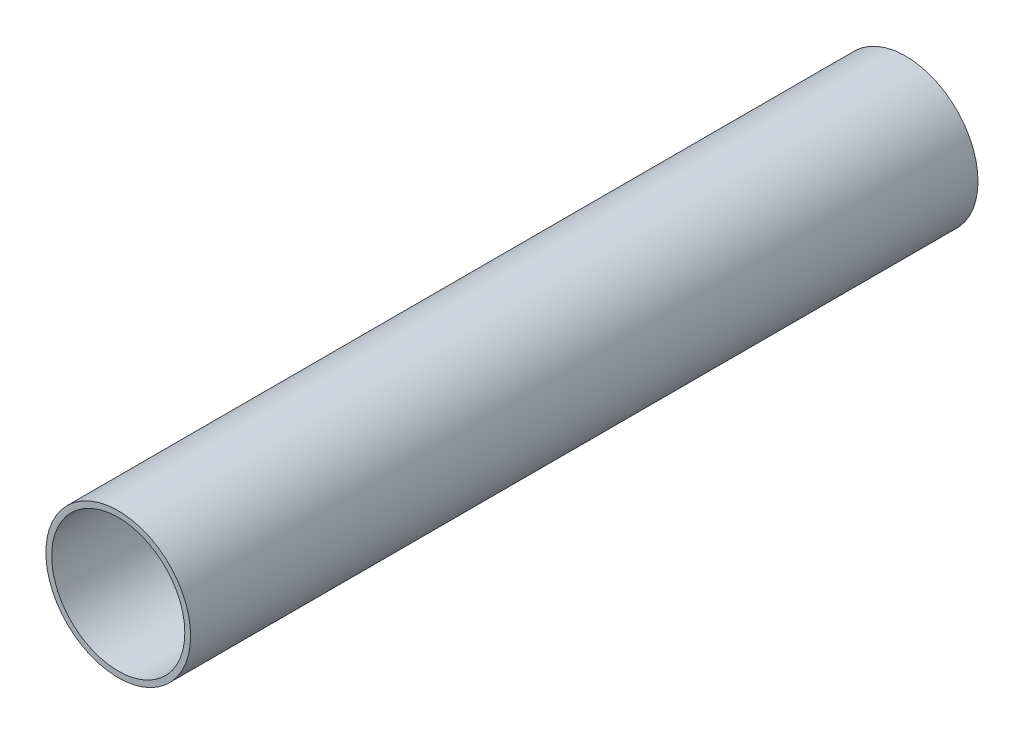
ISO-10303-21;
HEADER;
FILE_DESCRIPTION(('STEP AP214'),'2;1');
FILE_NAME('part.step','',(''),(''),'','','');
FILE_SCHEMA(('AUTOMOTIVE_DESIGN { 1 0 10303 214 1 1 1 1 }'));
ENDSEC;
DATA;
#1=APPLICATION_CONTEXT('core data for automotive mechanical design processes');
#2=APPLICATION_PROTOCOL_DEFINITION('international standard','automotive_design',2000,#1);
#3=PRODUCT_CONTEXT('',#1,'mechanical');
#4=PRODUCT('Part','Part','',(#3));
#5=PRODUCT_RELATED_PRODUCT_CATEGORY('part','',(#4));
#6=PRODUCT_DEFINITION_FORMATION('','',#4);
#7=PRODUCT_DEFINITION_CONTEXT('part definition',#1,'design');
#8=PRODUCT_DEFINITION('design','',#6,#7);
#9=PRODUCT_DEFINITION_SHAPE('','',#8);
#10=(LENGTH_UNIT() NAMED_UNIT(*) SI_UNIT(.MILLI.,.METRE.));
#11=(NAMED_UNIT(*) PLANE_ANGLE_UNIT() SI_UNIT($,.RADIAN.));
#12=(NAMED_UNIT(*) SI_UNIT($,.STERADIAN.) SOLID_ANGLE_UNIT());
#13=UNCERTAINTY_MEASURE_WITH_UNIT(LENGTH_MEASURE(1.E-05),#10,'distance_accuracy_value','');
#14=(GEOMETRIC_REPRESENTATION_CONTEXT(3) GLOBAL_UNCERTAINTY_ASSIGNED_CONTEXT((#13)) GLOBAL_UNIT_ASSIGNED_CONTEXT((#10,
#11,#12)) REPRESENTATION_CONTEXT('',''));
#15=CARTESIAN_POINT('',(0.,0.,0.));
#16=DIRECTION('',(0.,0.,1.));
#17=DIRECTION('',(1.,0.,0.));
#18=AXIS2_PLACEMENT_3D('',#15,#16,#17);
#19=CARTESIAN_POINT('',(0.,0.,-136.));
#20=DIRECTION('',(0.,0.,1.));
#21=DIRECTION('',(1.,0.,0.));
#22=AXIS2_PLACEMENT_3D('',#19,#20,#21);
#23=CYLINDRICAL_SURFACE('',#22,25.);
#24=CARTESIAN_POINT('',(0.,0.,-136.));
#25=DIRECTION('',(0.,0.,1.));
#26=DIRECTION('',(1.,0.,0.));
#27=AXIS2_PLACEMENT_3D('',#24,#25,#26);
#28=CIRCLE('',#27,25.);
#29=CARTESIAN_POINT('',(25.,0.,-136.));
#30=VERTEX_POINT('',#29);
#31=EDGE_CURVE('E10',#30,#30,#28,.T.);
#32=ORIENTED_EDGE('',*,*,#31,.T.);
#33=EDGE_LOOP('',(#32));
#34=FACE_BOUND('',#33,.T.);
#35=CARTESIAN_POINT('',(0.,0.,136.));
#36=DIRECTION('',(0.,0.,1.));
#37=DIRECTION('',(1.,0.,0.));
#38=AXIS2_PLACEMENT_3D('',#35,#36,#37);
#39=CIRCLE('',#38,25.);
#40=CARTESIAN_POINT('',(25.,0.,136.));
#41=VERTEX_POINT('',#40);
#42=EDGE_CURVE('E45',#41,#41,#39,.T.);
#43=ORIENTED_EDGE('',*,*,#42,.F.);
#44=EDGE_LOOP('',(#43));
#45=FACE_BOUND('',#44,.T.);
#46=ADVANCED_FACE('F35',(#34,#45),#23,.T.);
#47=CARTESIAN_POINT('',(0.,0.,-136.));
#48=DIRECTION('',(0.,0.,1.));
#49=DIRECTION('',(1.,0.,0.));
#50=AXIS2_PLACEMENT_3D('',#47,#48,#49);
#51=PLANE('',#50);
#52=CARTESIAN_POINT('',(0.,0.,-136.));
#53=DIRECTION('',(0.,0.,1.));
#54=DIRECTION('',(1.,0.,0.));
#55=AXIS2_PLACEMENT_3D('',#52,#53,#54);
#56=CIRCLE('',#55,23.);
#57=CARTESIAN_POINT('',(23.,0.,-136.));
#58=VERTEX_POINT('',#57);
#59=EDGE_CURVE('E41',#58,#58,#56,.T.);
#60=ORIENTED_EDGE('',*,*,#59,.T.);
#61=EDGE_LOOP('',(#60));
#62=FACE_BOUND('',#61,.T.);
#63=ORIENTED_EDGE('',*,*,#31,.F.);
#64=EDGE_LOOP('',(#63));
#65=FACE_BOUND('',#64,.T.);
#66=ADVANCED_FACE('F64',(#62,#65),#51,.F.);
#67=CARTESIAN_POINT('',(0.,0.,-136.));
#68=DIRECTION('',(0.,0.,1.));
#69=DIRECTION('',(1.,0.,0.));
#70=AXIS2_PLACEMENT_3D('',#67,#68,#69);
#71=CYLINDRICAL_SURFACE('',#70,23.);
#72=ORIENTED_EDGE('',*,*,#59,.F.);
#73=EDGE_LOOP('',(#72));
#74=FACE_BOUND('',#73,.T.);
#75=CARTESIAN_POINT('',(0.,0.,136.));
#76=DIRECTION('',(0.,0.,1.));
#77=DIRECTION('',(1.,0.,0.));
#78=AXIS2_PLACEMENT_3D('',#75,#76,#77);
#79=CIRCLE('',#78,23.);
#80=CARTESIAN_POINT('',(23.,0.,136.));
#81=VERTEX_POINT('',#80);
#82=EDGE_CURVE('E49',#81,#81,#79,.T.);
#83=ORIENTED_EDGE('',*,*,#82,.T.);
#84=EDGE_LOOP('',(#83));
#85=FACE_BOUND('',#84,.T.);
#86=ADVANCED_FACE('F55',(#74,#85),#71,.F.);
#87=CARTESIAN_POINT('',(0.,0.,136.));
#88=DIRECTION('',(0.,0.,1.));
#89=DIRECTION('',(1.,0.,0.));
#90=AXIS2_PLACEMENT_3D('',#87,#88,#89);
#91=PLANE('',#90);
#92=ORIENTED_EDGE('',*,*,#42,.T.);
#93=EDGE_LOOP('',(#92));
#94=FACE_BOUND('',#93,.T.);
#95=ORIENTED_EDGE('',*,*,#82,.F.);
#96=EDGE_LOOP('',(#95));
#97=FACE_BOUND('',#96,.T.);
#98=ADVANCED_FACE('F57',(#94,#97),#91,.T.);
#99=CLOSED_SHELL('',(#46,#66,#86,#98));
#100=MANIFOLD_SOLID_BREP('B2',#99);
#101=ADVANCED_BREP_SHAPE_REPRESENTATION('',(#18,#100),#14);
#102=SHAPE_DEFINITION_REPRESENTATION(#9,#101);
ENDSEC;
END-ISO-10303-21;
